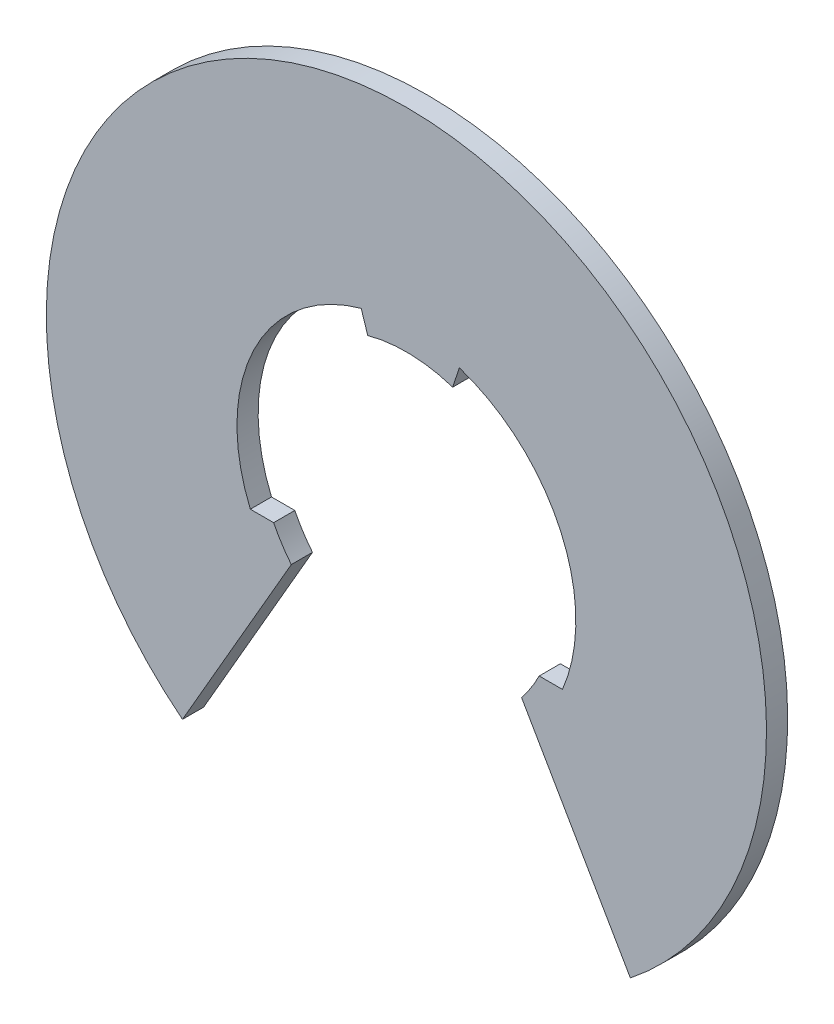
ISO-10303-21;
HEADER;
FILE_DESCRIPTION(('STEP AP214'),'2;1');
FILE_NAME('part.step','',(''),(''),'','','');
FILE_SCHEMA(('AUTOMOTIVE_DESIGN { 1 0 10303 214 1 1 1 1 }'));
ENDSEC;
DATA;
#1=APPLICATION_CONTEXT('core data for automotive mechanical design processes');
#2=APPLICATION_PROTOCOL_DEFINITION('international standard','automotive_design',2000,#1);
#3=PRODUCT_CONTEXT('',#1,'mechanical');
#4=PRODUCT('Part','Part','',(#3));
#5=PRODUCT_RELATED_PRODUCT_CATEGORY('part','',(#4));
#6=PRODUCT_DEFINITION_FORMATION('','',#4);
#7=PRODUCT_DEFINITION_CONTEXT('part definition',#1,'design');
#8=PRODUCT_DEFINITION('design','',#6,#7);
#9=PRODUCT_DEFINITION_SHAPE('','',#8);
#10=(LENGTH_UNIT() NAMED_UNIT(*) SI_UNIT(.MILLI.,.METRE.));
#11=(NAMED_UNIT(*) PLANE_ANGLE_UNIT() SI_UNIT($,.RADIAN.));
#12=(NAMED_UNIT(*) SI_UNIT($,.STERADIAN.) SOLID_ANGLE_UNIT());
#13=UNCERTAINTY_MEASURE_WITH_UNIT(LENGTH_MEASURE(1.E-05),#10,'distance_accuracy_value','');
#14=(GEOMETRIC_REPRESENTATION_CONTEXT(3) GLOBAL_UNCERTAINTY_ASSIGNED_CONTEXT((#13)) GLOBAL_UNIT_ASSIGNED_CONTEXT((#10,
#11,#12)) REPRESENTATION_CONTEXT('',''));
#15=CARTESIAN_POINT('',(0.,0.,0.));
#16=DIRECTION('',(0.,0.,1.));
#17=DIRECTION('',(1.,0.,0.));
#18=AXIS2_PLACEMENT_3D('',#15,#16,#17);
#19=CARTESIAN_POINT('',(0.,0.,0.2));
#20=DIRECTION('',(0.,0.,-1.));
#21=DIRECTION('',(-1.,0.,0.));
#22=AXIS2_PLACEMENT_3D('',#19,#20,#21);
#23=CYLINDRICAL_SURFACE('',#22,1.40000000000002);
#24=CARTESIAN_POINT('',(0.,0.,0.));
#25=DIRECTION('',(0.,0.,-1.));
#26=DIRECTION('',(1.,0.,0.));
#27=AXIS2_PLACEMENT_3D('',#24,#25,#26);
#28=CIRCLE('',#27,1.40000000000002);
#29=CARTESIAN_POINT('',(-1.0868541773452,-0.88246699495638,0.));
#30=VERTEX_POINT('',#29);
#31=CARTESIAN_POINT('',(-1.25363636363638,-0.623214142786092,0.));
#32=VERTEX_POINT('',#31);
#33=EDGE_CURVE('E152',#30,#32,#28,.T.);
#34=ORIENTED_EDGE('',*,*,#33,.T.);
#35=DIRECTION('',(0.,0.,-1.));
#36=VECTOR('',#35,1.);
#37=CARTESIAN_POINT('',(-1.25363636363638,-0.623214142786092,0.2));
#38=LINE('',#37,#36);
#39=CARTESIAN_POINT('',(-1.25363636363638,-0.623214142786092,0.2));
#40=VERTEX_POINT('',#39);
#41=EDGE_CURVE('E11',#40,#32,#38,.T.);
#42=ORIENTED_EDGE('',*,*,#41,.F.);
#43=CARTESIAN_POINT('',(0.,0.,0.2));
#44=DIRECTION('',(0.,0.,-1.));
#45=DIRECTION('',(1.,0.,0.));
#46=AXIS2_PLACEMENT_3D('',#43,#44,#45);
#47=CIRCLE('',#46,1.40000000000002);
#48=CARTESIAN_POINT('',(-1.0868541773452,-0.88246699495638,0.2));
#49=VERTEX_POINT('',#48);
#50=EDGE_CURVE('E176',#49,#40,#47,.T.);
#51=ORIENTED_EDGE('',*,*,#50,.F.);
#52=DIRECTION('',(0.,0.,-1.));
#53=VECTOR('',#52,1.);
#54=CARTESIAN_POINT('',(-1.0868541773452,-0.88246699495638,0.2));
#55=LINE('',#54,#53);
#56=EDGE_CURVE('E148',#49,#30,#55,.T.);
#57=ORIENTED_EDGE('',*,*,#56,.T.);
#58=EDGE_LOOP('',(#34,#42,#51,#57));
#59=FACE_BOUND('',#58,.T.);
#60=ADVANCED_FACE('F32',(#59),#23,.F.);
#61=CARTESIAN_POINT('',(-1.25363636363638,-0.623214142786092,0.2));
#62=DIRECTION('',(0.,-1.,0.));
#63=DIRECTION('',(0.,0.,-1.));
#64=AXIS2_PLACEMENT_3D('',#61,#62,#63);
#65=PLANE('',#64);
#66=DIRECTION('',(-1.,0.,0.));
#67=VECTOR('',#66,1.);
#68=CARTESIAN_POINT('',(-1.25363636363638,-0.623214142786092,0.));
#69=LINE('',#68,#67);
#70=CARTESIAN_POINT('',(-1.47363636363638,-0.623214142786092,0.));
#71=VERTEX_POINT('',#70);
#72=EDGE_CURVE('E155',#32,#71,#69,.T.);
#73=ORIENTED_EDGE('',*,*,#72,.T.);
#74=DIRECTION('',(0.,0.,-1.));
#75=VECTOR('',#74,1.);
#76=CARTESIAN_POINT('',(-1.47363636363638,-0.623214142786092,0.2));
#77=LINE('',#76,#75);
#78=CARTESIAN_POINT('',(-1.47363636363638,-0.623214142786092,0.2));
#79=VERTEX_POINT('',#78);
#80=EDGE_CURVE('E40',#79,#71,#77,.T.);
#81=ORIENTED_EDGE('',*,*,#80,.F.);
#82=DIRECTION('',(-1.,0.,0.));
#83=VECTOR('',#82,1.);
#84=CARTESIAN_POINT('',(-1.25363636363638,-0.623214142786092,0.2));
#85=LINE('',#84,#83);
#86=EDGE_CURVE('E101',#40,#79,#85,.T.);
#87=ORIENTED_EDGE('',*,*,#86,.F.);
#88=ORIENTED_EDGE('',*,*,#41,.T.);
#89=EDGE_LOOP('',(#73,#81,#87,#88));
#90=FACE_BOUND('',#89,.T.);
#91=ADVANCED_FACE('F245',(#90),#65,.F.);
#92=CARTESIAN_POINT('',(0.,0.,0.2));
#93=DIRECTION('',(0.,0.,-1.));
#94=DIRECTION('',(-1.,0.,0.));
#95=AXIS2_PLACEMENT_3D('',#92,#93,#94);
#96=CYLINDRICAL_SURFACE('',#95,1.60000000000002);
#97=CARTESIAN_POINT('',(0.,0.,0.));
#98=DIRECTION('',(0.,0.,-1.));
#99=DIRECTION('',(1.,0.,0.));
#100=AXIS2_PLACEMENT_3D('',#97,#98,#99);
#101=CIRCLE('',#100,1.60000000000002);
#102=CARTESIAN_POINT('',(-0.42680570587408,1.5420236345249,0.));
#103=VERTEX_POINT('',#102);
#104=EDGE_CURVE('E157',#71,#103,#101,.T.);
#105=ORIENTED_EDGE('',*,*,#104,.T.);
#106=DIRECTION('',(0.,0.,-1.));
#107=VECTOR('',#106,1.);
#108=CARTESIAN_POINT('',(-0.42680570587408,1.5420236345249,0.2));
#109=LINE('',#108,#107);
#110=CARTESIAN_POINT('',(-0.42680570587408,1.5420236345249,0.2));
#111=VERTEX_POINT('',#110);
#112=EDGE_CURVE('E195',#111,#103,#109,.T.);
#113=ORIENTED_EDGE('',*,*,#112,.F.);
#114=CARTESIAN_POINT('',(0.,0.,0.2));
#115=DIRECTION('',(0.,0.,-1.));
#116=DIRECTION('',(1.,0.,0.));
#117=AXIS2_PLACEMENT_3D('',#114,#115,#116);
#118=CIRCLE('',#117,1.60000000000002);
#119=EDGE_CURVE('E203',#79,#111,#118,.T.);
#120=ORIENTED_EDGE('',*,*,#119,.F.);
#121=ORIENTED_EDGE('',*,*,#80,.T.);
#122=EDGE_LOOP('',(#105,#113,#120,#121));
#123=FACE_BOUND('',#122,.T.);
#124=ADVANCED_FACE('F201',(#123),#96,.F.);
#125=CARTESIAN_POINT('',(-0.42680570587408,1.5420236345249,0.2));
#126=DIRECTION('',(0.951056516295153,0.309016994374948,0.));
#127=DIRECTION('',(-0.309016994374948,0.951056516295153,0.));
#128=AXIS2_PLACEMENT_3D('',#125,#126,#127);
#129=PLANE('',#128);
#130=DIRECTION('',(0.309016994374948,-0.951056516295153,0.));
#131=VECTOR('',#130,1.);
#132=CARTESIAN_POINT('',(-0.42680570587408,1.5420236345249,0.));
#133=LINE('',#132,#131);
#134=CARTESIAN_POINT('',(-0.364933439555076,1.35160037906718,0.));
#135=VERTEX_POINT('',#134);
#136=EDGE_CURVE('E159',#103,#135,#133,.T.);
#137=ORIENTED_EDGE('',*,*,#136,.T.);
#138=DIRECTION('',(0.,0.,-1.));
#139=VECTOR('',#138,1.);
#140=CARTESIAN_POINT('',(-0.364933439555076,1.35160037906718,0.2));
#141=LINE('',#140,#139);
#142=CARTESIAN_POINT('',(-0.364933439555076,1.35160037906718,0.2));
#143=VERTEX_POINT('',#142);
#144=EDGE_CURVE('E192',#143,#135,#141,.T.);
#145=ORIENTED_EDGE('',*,*,#144,.F.);
#146=DIRECTION('',(0.309016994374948,-0.951056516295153,0.));
#147=VECTOR('',#146,1.);
#148=CARTESIAN_POINT('',(-0.42680570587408,1.5420236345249,0.2));
#149=LINE('',#148,#147);
#150=EDGE_CURVE('E219',#111,#143,#149,.T.);
#151=ORIENTED_EDGE('',*,*,#150,.F.);
#152=ORIENTED_EDGE('',*,*,#112,.T.);
#153=EDGE_LOOP('',(#137,#145,#151,#152));
#154=FACE_BOUND('',#153,.T.);
#155=ADVANCED_FACE('F210',(#154),#129,.F.);
#156=CARTESIAN_POINT('',(0.,0.,0.2));
#157=DIRECTION('',(0.,0.,-1.));
#158=DIRECTION('',(-1.,0.,0.));
#159=AXIS2_PLACEMENT_3D('',#156,#157,#158);
#160=CYLINDRICAL_SURFACE('',#159,1.40000000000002);
#161=CARTESIAN_POINT('',(0.,0.,0.));
#162=DIRECTION('',(0.,0.,-1.));
#163=DIRECTION('',(1.,0.,0.));
#164=AXIS2_PLACEMENT_3D('',#161,#162,#163);
#165=CIRCLE('',#164,1.40000000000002);
#166=CARTESIAN_POINT('',(0.437149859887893,1.33000000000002,0.));
#167=VERTEX_POINT('',#166);
#168=EDGE_CURVE('E161',#135,#167,#165,.T.);
#169=ORIENTED_EDGE('',*,*,#168,.T.);
#170=DIRECTION('',(0.,0.,-1.));
#171=VECTOR('',#170,1.);
#172=CARTESIAN_POINT('',(0.437149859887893,1.33000000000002,0.2));
#173=LINE('',#172,#171);
#174=CARTESIAN_POINT('',(0.437149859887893,1.33000000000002,0.2));
#175=VERTEX_POINT('',#174);
#176=EDGE_CURVE('E189',#175,#167,#173,.T.);
#177=ORIENTED_EDGE('',*,*,#176,.F.);
#178=CARTESIAN_POINT('',(0.,0.,0.2));
#179=DIRECTION('',(0.,0.,-1.));
#180=DIRECTION('',(1.,0.,0.));
#181=AXIS2_PLACEMENT_3D('',#178,#179,#180);
#182=CIRCLE('',#181,1.40000000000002);
#183=EDGE_CURVE('E216',#143,#175,#182,.T.);
#184=ORIENTED_EDGE('',*,*,#183,.F.);
#185=ORIENTED_EDGE('',*,*,#144,.T.);
#186=EDGE_LOOP('',(#169,#177,#184,#185));
#187=FACE_BOUND('',#186,.T.);
#188=ADVANCED_FACE('F214',(#187),#160,.F.);
#189=CARTESIAN_POINT('',(0.437149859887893,1.33000000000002,0.2));
#190=DIRECTION('',(-0.95,0.312249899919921,0.));
#191=DIRECTION('',(-0.312249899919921,-0.95,0.));
#192=AXIS2_PLACEMENT_3D('',#189,#190,#191);
#193=PLANE('',#192);
#194=DIRECTION('',(0.312249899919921,0.95,0.));
#195=VECTOR('',#194,1.);
#196=CARTESIAN_POINT('',(0.437149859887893,1.33000000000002,0.));
#197=LINE('',#196,#195);
#198=CARTESIAN_POINT('',(0.499599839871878,1.52000000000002,0.));
#199=VERTEX_POINT('',#198);
#200=EDGE_CURVE('E163',#167,#199,#197,.T.);
#201=ORIENTED_EDGE('',*,*,#200,.T.);
#202=DIRECTION('',(0.,0.,-1.));
#203=VECTOR('',#202,1.);
#204=CARTESIAN_POINT('',(0.499599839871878,1.52000000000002,0.2));
#205=LINE('',#204,#203);
#206=CARTESIAN_POINT('',(0.499599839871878,1.52000000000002,0.2));
#207=VERTEX_POINT('',#206);
#208=EDGE_CURVE('E186',#207,#199,#205,.T.);
#209=ORIENTED_EDGE('',*,*,#208,.F.);
#210=DIRECTION('',(0.312249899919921,0.95,0.));
#211=VECTOR('',#210,1.);
#212=CARTESIAN_POINT('',(0.437149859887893,1.33000000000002,0.2));
#213=LINE('',#212,#211);
#214=EDGE_CURVE('E218',#175,#207,#213,.T.);
#215=ORIENTED_EDGE('',*,*,#214,.F.);
#216=ORIENTED_EDGE('',*,*,#176,.T.);
#217=EDGE_LOOP('',(#201,#209,#215,#216));
#218=FACE_BOUND('',#217,.T.);
#219=ADVANCED_FACE('F257',(#218),#193,.F.);
#220=CARTESIAN_POINT('',(0.,0.,0.2));
#221=DIRECTION('',(0.,0.,-1.));
#222=DIRECTION('',(-1.,0.,0.));
#223=AXIS2_PLACEMENT_3D('',#220,#221,#222);
#224=CYLINDRICAL_SURFACE('',#223,1.60000000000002);
#225=CARTESIAN_POINT('',(0.,0.,0.));
#226=DIRECTION('',(0.,0.,-1.));
#227=DIRECTION('',(1.,0.,0.));
#228=AXIS2_PLACEMENT_3D('',#225,#226,#227);
#229=CIRCLE('',#228,1.60000000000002);
#230=CARTESIAN_POINT('',(1.47363636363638,-0.623214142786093,0.));
#231=VERTEX_POINT('',#230);
#232=EDGE_CURVE('E165',#199,#231,#229,.T.);
#233=ORIENTED_EDGE('',*,*,#232,.T.);
#234=DIRECTION('',(0.,0.,-1.));
#235=VECTOR('',#234,1.);
#236=CARTESIAN_POINT('',(1.47363636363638,-0.623214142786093,0.2));
#237=LINE('',#236,#235);
#238=CARTESIAN_POINT('',(1.47363636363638,-0.623214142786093,0.2));
#239=VERTEX_POINT('',#238);
#240=EDGE_CURVE('E183',#239,#231,#237,.T.);
#241=ORIENTED_EDGE('',*,*,#240,.F.);
#242=CARTESIAN_POINT('',(0.,0.,0.2));
#243=DIRECTION('',(0.,0.,-1.));
#244=DIRECTION('',(1.,0.,0.));
#245=AXIS2_PLACEMENT_3D('',#242,#243,#244);
#246=CIRCLE('',#245,1.60000000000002);
#247=EDGE_CURVE('E221',#207,#239,#246,.T.);
#248=ORIENTED_EDGE('',*,*,#247,.F.);
#249=ORIENTED_EDGE('',*,*,#208,.T.);
#250=EDGE_LOOP('',(#233,#241,#248,#249));
#251=FACE_BOUND('',#250,.T.);
#252=ADVANCED_FACE('F260',(#251),#224,.F.);
#253=CARTESIAN_POINT('',(1.25363636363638,-0.623214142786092,0.2));
#254=DIRECTION('',(0.,-1.,0.));
#255=DIRECTION('',(0.,0.,-1.));
#256=AXIS2_PLACEMENT_3D('',#253,#254,#255);
#257=PLANE('',#256);
#258=DIRECTION('',(-1.,0.,0.));
#259=VECTOR('',#258,1.);
#260=CARTESIAN_POINT('',(1.25363636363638,-0.623214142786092,0.));
#261=LINE('',#260,#259);
#262=CARTESIAN_POINT('',(1.25363636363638,-0.623214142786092,0.));
#263=VERTEX_POINT('',#262);
#264=EDGE_CURVE('E167',#231,#263,#261,.T.);
#265=ORIENTED_EDGE('',*,*,#264,.T.);
#266=DIRECTION('',(0.,0.,-1.));
#267=VECTOR('',#266,1.);
#268=CARTESIAN_POINT('',(1.25363636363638,-0.623214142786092,0.2));
#269=LINE('',#268,#267);
#270=CARTESIAN_POINT('',(1.25363636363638,-0.623214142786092,0.2));
#271=VERTEX_POINT('',#270);
#272=EDGE_CURVE('E180',#271,#263,#269,.T.);
#273=ORIENTED_EDGE('',*,*,#272,.F.);
#274=DIRECTION('',(-1.,0.,0.));
#275=VECTOR('',#274,1.);
#276=CARTESIAN_POINT('',(1.25363636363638,-0.623214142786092,0.2));
#277=LINE('',#276,#275);
#278=EDGE_CURVE('E227',#239,#271,#277,.T.);
#279=ORIENTED_EDGE('',*,*,#278,.F.);
#280=ORIENTED_EDGE('',*,*,#240,.T.);
#281=EDGE_LOOP('',(#265,#273,#279,#280));
#282=FACE_BOUND('',#281,.T.);
#283=ADVANCED_FACE('F233',(#282),#257,.F.);
#284=CARTESIAN_POINT('',(0.,0.,0.2));
#285=DIRECTION('',(0.,0.,-1.));
#286=DIRECTION('',(-1.,0.,0.));
#287=AXIS2_PLACEMENT_3D('',#284,#285,#286);
#288=CYLINDRICAL_SURFACE('',#287,1.40000000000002);
#289=CARTESIAN_POINT('',(0.,0.,0.));
#290=DIRECTION('',(0.,0.,-1.));
#291=DIRECTION('',(1.,0.,0.));
#292=AXIS2_PLACEMENT_3D('',#289,#290,#291);
#293=CIRCLE('',#292,1.40000000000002);
#294=CARTESIAN_POINT('',(1.0868541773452,-0.882466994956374,0.));
#295=VERTEX_POINT('',#294);
#296=EDGE_CURVE('E169',#263,#295,#293,.T.);
#297=ORIENTED_EDGE('',*,*,#296,.T.);
#298=DIRECTION('',(0.,0.,-1.));
#299=VECTOR('',#298,1.);
#300=CARTESIAN_POINT('',(1.0868541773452,-0.882466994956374,0.2));
#301=LINE('',#300,#299);
#302=CARTESIAN_POINT('',(1.0868541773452,-0.882466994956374,0.2));
#303=VERTEX_POINT('',#302);
#304=EDGE_CURVE('E143',#303,#295,#301,.T.);
#305=ORIENTED_EDGE('',*,*,#304,.F.);
#306=CARTESIAN_POINT('',(0.,0.,0.2));
#307=DIRECTION('',(0.,0.,-1.));
#308=DIRECTION('',(1.,0.,0.));
#309=AXIS2_PLACEMENT_3D('',#306,#307,#308);
#310=CIRCLE('',#309,1.40000000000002);
#311=EDGE_CURVE('E133',#271,#303,#310,.T.);
#312=ORIENTED_EDGE('',*,*,#311,.F.);
#313=ORIENTED_EDGE('',*,*,#272,.T.);
#314=EDGE_LOOP('',(#297,#305,#312,#313));
#315=FACE_BOUND('',#314,.T.);
#316=ADVANCED_FACE('F237',(#315),#288,.F.);
#317=CARTESIAN_POINT('',(1.19077722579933,-1.06246699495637,0.2));
#318=DIRECTION('',(0.866025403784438,0.500000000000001,0.));
#319=DIRECTION('',(-0.500000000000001,0.866025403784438,0.));
#320=AXIS2_PLACEMENT_3D('',#317,#318,#319);
#321=PLANE('',#320);
#322=DIRECTION('',(0.500000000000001,-0.866025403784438,0.));
#323=VECTOR('',#322,1.);
#324=CARTESIAN_POINT('',(1.19077722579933,-1.06246699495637,0.));
#325=LINE('',#324,#323);
#326=CARTESIAN_POINT('',(2.11453765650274,-2.66246699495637,0.));
#327=VERTEX_POINT('',#326);
#328=EDGE_CURVE('E141',#295,#327,#325,.T.);
#329=ORIENTED_EDGE('',*,*,#328,.T.);
#330=DIRECTION('',(0.,0.,-1.));
#331=VECTOR('',#330,1.);
#332=CARTESIAN_POINT('',(2.11453765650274,-2.66246699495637,0.2));
#333=LINE('',#332,#331);
#334=CARTESIAN_POINT('',(2.11453765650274,-2.66246699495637,0.2));
#335=VERTEX_POINT('',#334);
#336=EDGE_CURVE('E139',#335,#327,#333,.T.);
#337=ORIENTED_EDGE('',*,*,#336,.F.);
#338=DIRECTION('',(0.5,-0.866025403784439,0.));
#339=VECTOR('',#338,1.);
#340=CARTESIAN_POINT('',(1.0868541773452,-0.882466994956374,0.2));
#341=LINE('',#340,#339);
#342=EDGE_CURVE('E126',#303,#335,#341,.T.);
#343=ORIENTED_EDGE('',*,*,#342,.F.);
#344=ORIENTED_EDGE('',*,*,#304,.T.);
#345=EDGE_LOOP('',(#329,#337,#343,#344));
#346=FACE_BOUND('',#345,.T.);
#347=ADVANCED_FACE('F140',(#346),#321,.F.);
#348=CARTESIAN_POINT('',(0.,0.,0.2));
#349=DIRECTION('',(0.,0.,-1.));
#350=DIRECTION('',(-1.,0.,0.));
#351=AXIS2_PLACEMENT_3D('',#348,#349,#350);
#352=CYLINDRICAL_SURFACE('',#351,3.40000000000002);
#353=CARTESIAN_POINT('',(0.,0.,0.));
#354=DIRECTION('',(0.,0.,1.));
#355=DIRECTION('',(1.,0.,0.));
#356=AXIS2_PLACEMENT_3D('',#353,#354,#355);
#357=CIRCLE('',#356,3.40000000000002);
#358=CARTESIAN_POINT('',(-2.11453765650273,-2.66246699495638,0.));
#359=VERTEX_POINT('',#358);
#360=EDGE_CURVE('E173',#327,#359,#357,.T.);
#361=ORIENTED_EDGE('',*,*,#360,.T.);
#362=DIRECTION('',(0.,0.,-1.));
#363=VECTOR('',#362,1.);
#364=CARTESIAN_POINT('',(-2.11453765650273,-2.66246699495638,0.2));
#365=LINE('',#364,#363);
#366=CARTESIAN_POINT('',(-2.11453765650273,-2.66246699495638,0.2));
#367=VERTEX_POINT('',#366);
#368=EDGE_CURVE('E144',#367,#359,#365,.T.);
#369=ORIENTED_EDGE('',*,*,#368,.F.);
#370=CARTESIAN_POINT('',(0.,0.,0.2));
#371=DIRECTION('',(0.,0.,1.));
#372=DIRECTION('',(1.,0.,0.));
#373=AXIS2_PLACEMENT_3D('',#370,#371,#372);
#374=CIRCLE('',#373,3.40000000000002);
#375=EDGE_CURVE('E130',#335,#367,#374,.T.);
#376=ORIENTED_EDGE('',*,*,#375,.F.);
#377=ORIENTED_EDGE('',*,*,#336,.T.);
#378=EDGE_LOOP('',(#361,#369,#376,#377));
#379=FACE_BOUND('',#378,.T.);
#380=ADVANCED_FACE('F146',(#379),#352,.T.);
#381=CARTESIAN_POINT('',(-1.0868541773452,-0.88246699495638,0.2));
#382=DIRECTION('',(-0.86602540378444,0.499999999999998,0.));
#383=DIRECTION('',(-0.499999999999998,-0.86602540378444,0.));
#384=AXIS2_PLACEMENT_3D('',#381,#382,#383);
#385=PLANE('',#384);
#386=DIRECTION('',(0.499999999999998,0.86602540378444,0.));
#387=VECTOR('',#386,1.);
#388=CARTESIAN_POINT('',(-1.0868541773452,-0.88246699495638,0.));
#389=LINE('',#388,#387);
#390=EDGE_CURVE('E89',#359,#30,#389,.T.);
#391=ORIENTED_EDGE('',*,*,#390,.T.);
#392=ORIENTED_EDGE('',*,*,#56,.F.);
#393=DIRECTION('',(0.5,0.866025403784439,0.));
#394=VECTOR('',#393,1.);
#395=CARTESIAN_POINT('',(-1.19077722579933,-1.06246699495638,0.2));
#396=LINE('',#395,#394);
#397=EDGE_CURVE('E48',#367,#49,#396,.T.);
#398=ORIENTED_EDGE('',*,*,#397,.F.);
#399=ORIENTED_EDGE('',*,*,#368,.T.);
#400=EDGE_LOOP('',(#391,#392,#398,#399));
#401=FACE_BOUND('',#400,.T.);
#402=ADVANCED_FACE('F239',(#401),#385,.F.);
#403=CARTESIAN_POINT('',(0.,0.,0.2));
#404=DIRECTION('',(0.,0.,1.));
#405=DIRECTION('',(1.,0.,0.));
#406=AXIS2_PLACEMENT_3D('',#403,#404,#405);
#407=PLANE('',#406);
#408=ORIENTED_EDGE('',*,*,#50,.T.);
#409=ORIENTED_EDGE('',*,*,#86,.T.);
#410=ORIENTED_EDGE('',*,*,#119,.T.);
#411=ORIENTED_EDGE('',*,*,#150,.T.);
#412=ORIENTED_EDGE('',*,*,#183,.T.);
#413=ORIENTED_EDGE('',*,*,#214,.T.);
#414=ORIENTED_EDGE('',*,*,#247,.T.);
#415=ORIENTED_EDGE('',*,*,#278,.T.);
#416=ORIENTED_EDGE('',*,*,#311,.T.);
#417=ORIENTED_EDGE('',*,*,#342,.T.);
#418=ORIENTED_EDGE('',*,*,#375,.T.);
#419=ORIENTED_EDGE('',*,*,#397,.T.);
#420=EDGE_LOOP('',(#408,#409,#410,#411,#412,#413,#414,#415,#416,#417,#418,#419));
#421=FACE_BOUND('',#420,.T.);
#422=ADVANCED_FACE('F128',(#421),#407,.T.);
#423=CARTESIAN_POINT('',(0.,0.,0.));
#424=DIRECTION('',(0.,0.,1.));
#425=DIRECTION('',(1.,0.,0.));
#426=AXIS2_PLACEMENT_3D('',#423,#424,#425);
#427=PLANE('',#426);
#428=ORIENTED_EDGE('',*,*,#33,.F.);
#429=ORIENTED_EDGE('',*,*,#390,.F.);
#430=ORIENTED_EDGE('',*,*,#360,.F.);
#431=ORIENTED_EDGE('',*,*,#328,.F.);
#432=ORIENTED_EDGE('',*,*,#296,.F.);
#433=ORIENTED_EDGE('',*,*,#264,.F.);
#434=ORIENTED_EDGE('',*,*,#232,.F.);
#435=ORIENTED_EDGE('',*,*,#200,.F.);
#436=ORIENTED_EDGE('',*,*,#168,.F.);
#437=ORIENTED_EDGE('',*,*,#136,.F.);
#438=ORIENTED_EDGE('',*,*,#104,.F.);
#439=ORIENTED_EDGE('',*,*,#72,.F.);
#440=EDGE_LOOP('',(#428,#429,#430,#431,#432,#433,#434,#435,#436,#437,#438,#439));
#441=FACE_BOUND('',#440,.T.);
#442=ADVANCED_FACE('F205',(#441),#427,.F.);
#443=CLOSED_SHELL('',(#60,#91,#124,#155,#188,#219,#252,#283,#316,#347,#380,#402,#422,#442));
#444=MANIFOLD_SOLID_BREP('B2',#443);
#445=ADVANCED_BREP_SHAPE_REPRESENTATION('',(#18,#444),#14);
#446=SHAPE_DEFINITION_REPRESENTATION(#9,#445);
ENDSEC;
END-ISO-10303-21;
